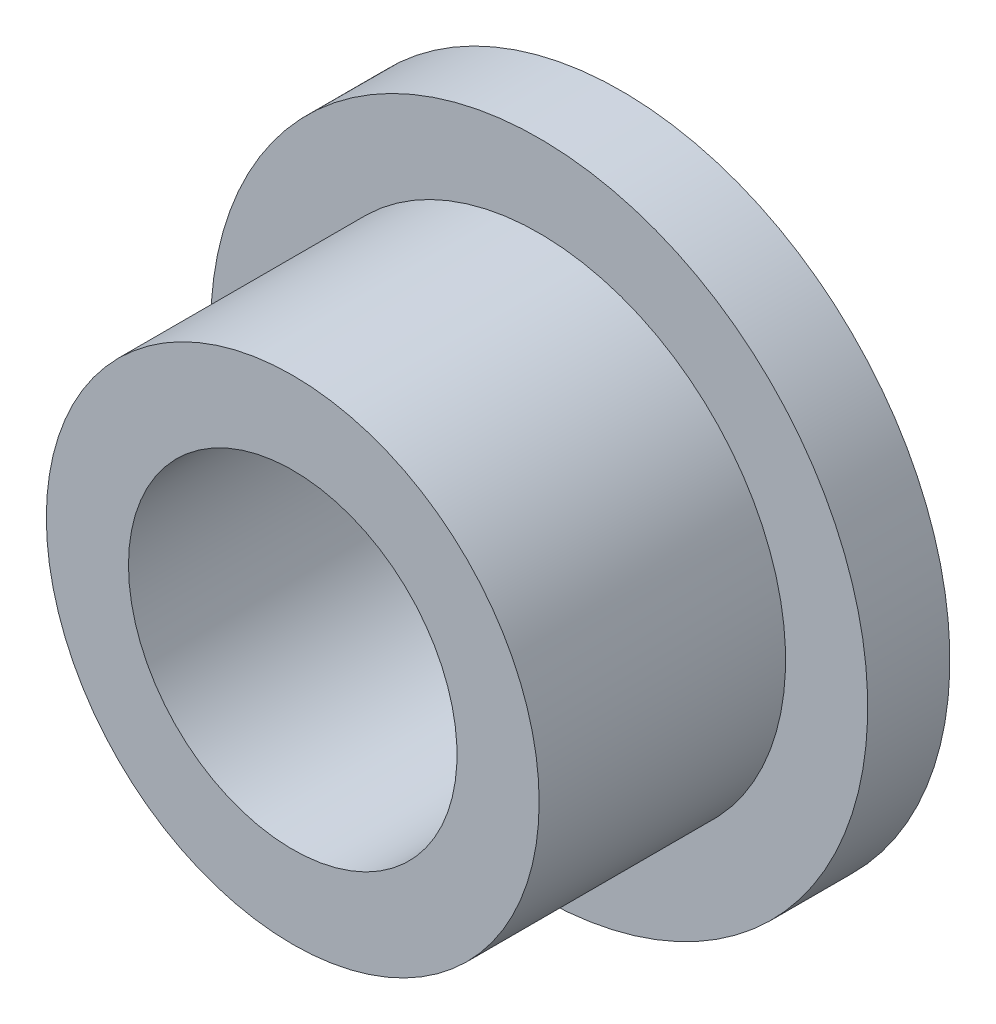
ISO-10303-21;
HEADER;
FILE_DESCRIPTION(('STEP AP214'),'2;1');
FILE_NAME('part.step','',(''),(''),'','','');
FILE_SCHEMA(('AUTOMOTIVE_DESIGN { 1 0 10303 214 1 1 1 1 }'));
ENDSEC;
DATA;
#1=APPLICATION_CONTEXT('core data for automotive mechanical design processes');
#2=APPLICATION_PROTOCOL_DEFINITION('international standard','automotive_design',2000,#1);
#3=PRODUCT_CONTEXT('',#1,'mechanical');
#4=PRODUCT('Part','Part','',(#3));
#5=PRODUCT_RELATED_PRODUCT_CATEGORY('part','',(#4));
#6=PRODUCT_DEFINITION_FORMATION('','',#4);
#7=PRODUCT_DEFINITION_CONTEXT('part definition',#1,'design');
#8=PRODUCT_DEFINITION('design','',#6,#7);
#9=PRODUCT_DEFINITION_SHAPE('','',#8);
#10=(LENGTH_UNIT() NAMED_UNIT(*) SI_UNIT(.MILLI.,.METRE.));
#11=(NAMED_UNIT(*) PLANE_ANGLE_UNIT() SI_UNIT($,.RADIAN.));
#12=(NAMED_UNIT(*) SI_UNIT($,.STERADIAN.) SOLID_ANGLE_UNIT());
#13=UNCERTAINTY_MEASURE_WITH_UNIT(LENGTH_MEASURE(1.E-05),#10,'distance_accuracy_value','');
#14=(GEOMETRIC_REPRESENTATION_CONTEXT(3) GLOBAL_UNCERTAINTY_ASSIGNED_CONTEXT((#13)) GLOBAL_UNIT_ASSIGNED_CONTEXT((#10,
#11,#12)) REPRESENTATION_CONTEXT('',''));
#15=CARTESIAN_POINT('',(0.,0.,0.));
#16=DIRECTION('',(0.,0.,1.));
#17=DIRECTION('',(1.,0.,0.));
#18=AXIS2_PLACEMENT_3D('',#15,#16,#17);
#19=CARTESIAN_POINT('',(0.,0.,15.));
#20=DIRECTION('',(0.,0.,-1.));
#21=DIRECTION('',(-1.,0.,0.));
#22=AXIS2_PLACEMENT_3D('',#19,#20,#21);
#23=CYLINDRICAL_SURFACE('',#22,15.);
#24=CARTESIAN_POINT('',(0.,0.,15.));
#25=DIRECTION('',(0.,0.,1.));
#26=DIRECTION('',(1.,0.,0.));
#27=AXIS2_PLACEMENT_3D('',#24,#25,#26);
#28=CIRCLE('',#27,15.);
#29=CARTESIAN_POINT('',(15.,0.,15.));
#30=VERTEX_POINT('',#29);
#31=EDGE_CURVE('E10',#30,#30,#28,.T.);
#32=ORIENTED_EDGE('',*,*,#31,.F.);
#33=EDGE_LOOP('',(#32));
#34=FACE_BOUND('',#33,.T.);
#35=CARTESIAN_POINT('',(0.,0.,0.));
#36=DIRECTION('',(0.,0.,-1.));
#37=DIRECTION('',(-1.,0.,0.));
#38=AXIS2_PLACEMENT_3D('',#35,#36,#37);
#39=CIRCLE('',#38,15.);
#40=CARTESIAN_POINT('',(-15.,0.,0.));
#41=VERTEX_POINT('',#40);
#42=EDGE_CURVE('E35',#41,#41,#39,.T.);
#43=ORIENTED_EDGE('',*,*,#42,.F.);
#44=EDGE_LOOP('',(#43));
#45=FACE_BOUND('',#44,.T.);
#46=ADVANCED_FACE('F29',(#34,#45),#23,.T.);
#47=CARTESIAN_POINT('',(0.,0.,15.));
#48=DIRECTION('',(0.,0.,1.));
#49=DIRECTION('',(1.,0.,0.));
#50=AXIS2_PLACEMENT_3D('',#47,#48,#49);
#51=PLANE('',#50);
#52=CARTESIAN_POINT('',(0.,0.,15.));
#53=DIRECTION('',(0.,0.,-1.));
#54=DIRECTION('',(-1.,0.,0.));
#55=AXIS2_PLACEMENT_3D('',#52,#53,#54);
#56=CIRCLE('',#55,10.);
#57=CARTESIAN_POINT('',(-10.,0.,15.));
#58=VERTEX_POINT('',#57);
#59=EDGE_CURVE('E48',#58,#58,#56,.T.);
#60=ORIENTED_EDGE('',*,*,#59,.T.);
#61=EDGE_LOOP('',(#60));
#62=FACE_BOUND('',#61,.T.);
#63=ORIENTED_EDGE('',*,*,#31,.T.);
#64=EDGE_LOOP('',(#63));
#65=FACE_BOUND('',#64,.T.);
#66=ADVANCED_FACE('F71',(#62,#65),#51,.T.);
#67=CARTESIAN_POINT('',(0.,0.,0.));
#68=DIRECTION('',(0.,0.,-1.));
#69=DIRECTION('',(-1.,0.,0.));
#70=AXIS2_PLACEMENT_3D('',#67,#68,#69);
#71=PLANE('',#70);
#72=CARTESIAN_POINT('',(0.,0.,0.));
#73=DIRECTION('',(0.,0.,-1.));
#74=DIRECTION('',(-1.,0.,0.));
#75=AXIS2_PLACEMENT_3D('',#72,#73,#74);
#76=CIRCLE('',#75,20.);
#77=CARTESIAN_POINT('',(-20.,0.,0.));
#78=VERTEX_POINT('',#77);
#79=EDGE_CURVE('E43',#78,#78,#76,.T.);
#80=ORIENTED_EDGE('',*,*,#79,.F.);
#81=EDGE_LOOP('',(#80));
#82=FACE_BOUND('',#81,.T.);
#83=ORIENTED_EDGE('',*,*,#42,.T.);
#84=EDGE_LOOP('',(#83));
#85=FACE_BOUND('',#84,.T.);
#86=ADVANCED_FACE('F66',(#82,#85),#71,.F.);
#87=CARTESIAN_POINT('',(0.,0.,-5.));
#88=DIRECTION('',(0.,0.,1.));
#89=DIRECTION('',(1.,0.,0.));
#90=AXIS2_PLACEMENT_3D('',#87,#88,#89);
#91=CYLINDRICAL_SURFACE('',#90,20.);
#92=CARTESIAN_POINT('',(0.,0.,-5.));
#93=DIRECTION('',(0.,0.,-1.));
#94=DIRECTION('',(-1.,0.,0.));
#95=AXIS2_PLACEMENT_3D('',#92,#93,#94);
#96=CIRCLE('',#95,20.);
#97=CARTESIAN_POINT('',(-20.,0.,-5.));
#98=VERTEX_POINT('',#97);
#99=EDGE_CURVE('E39',#98,#98,#96,.T.);
#100=ORIENTED_EDGE('',*,*,#99,.F.);
#101=EDGE_LOOP('',(#100));
#102=FACE_BOUND('',#101,.T.);
#103=ORIENTED_EDGE('',*,*,#79,.T.);
#104=EDGE_LOOP('',(#103));
#105=FACE_BOUND('',#104,.T.);
#106=ADVANCED_FACE('F60',(#102,#105),#91,.T.);
#107=CARTESIAN_POINT('',(0.,0.,-5.));
#108=DIRECTION('',(0.,0.,-1.));
#109=DIRECTION('',(-1.,0.,0.));
#110=AXIS2_PLACEMENT_3D('',#107,#108,#109);
#111=PLANE('',#110);
#112=CARTESIAN_POINT('',(0.,0.,-5.));
#113=DIRECTION('',(0.,0.,-1.));
#114=DIRECTION('',(-1.,0.,0.));
#115=AXIS2_PLACEMENT_3D('',#112,#113,#114);
#116=CIRCLE('',#115,10.);
#117=CARTESIAN_POINT('',(-10.,0.,-5.));
#118=VERTEX_POINT('',#117);
#119=EDGE_CURVE('E51',#118,#118,#116,.T.);
#120=ORIENTED_EDGE('',*,*,#119,.F.);
#121=EDGE_LOOP('',(#120));
#122=FACE_BOUND('',#121,.T.);
#123=ORIENTED_EDGE('',*,*,#99,.T.);
#124=EDGE_LOOP('',(#123));
#125=FACE_BOUND('',#124,.T.);
#126=ADVANCED_FACE('F57',(#122,#125),#111,.T.);
#127=CARTESIAN_POINT('',(0.,0.,15.));
#128=DIRECTION('',(0.,0.,-1.));
#129=DIRECTION('',(-1.,0.,0.));
#130=AXIS2_PLACEMENT_3D('',#127,#128,#129);
#131=CYLINDRICAL_SURFACE('',#130,10.);
#132=ORIENTED_EDGE('',*,*,#59,.F.);
#133=EDGE_LOOP('',(#132));
#134=FACE_BOUND('',#133,.T.);
#135=ORIENTED_EDGE('',*,*,#119,.T.);
#136=EDGE_LOOP('',(#135));
#137=FACE_BOUND('',#136,.T.);
#138=ADVANCED_FACE('F55',(#134,#137),#131,.F.);
#139=CLOSED_SHELL('',(#46,#66,#86,#106,#126,#138));
#140=MANIFOLD_SOLID_BREP('B2',#139);
#141=ADVANCED_BREP_SHAPE_REPRESENTATION('',(#18,#140),#14);
#142=SHAPE_DEFINITION_REPRESENTATION(#9,#141);
ENDSEC;
END-ISO-10303-21;
